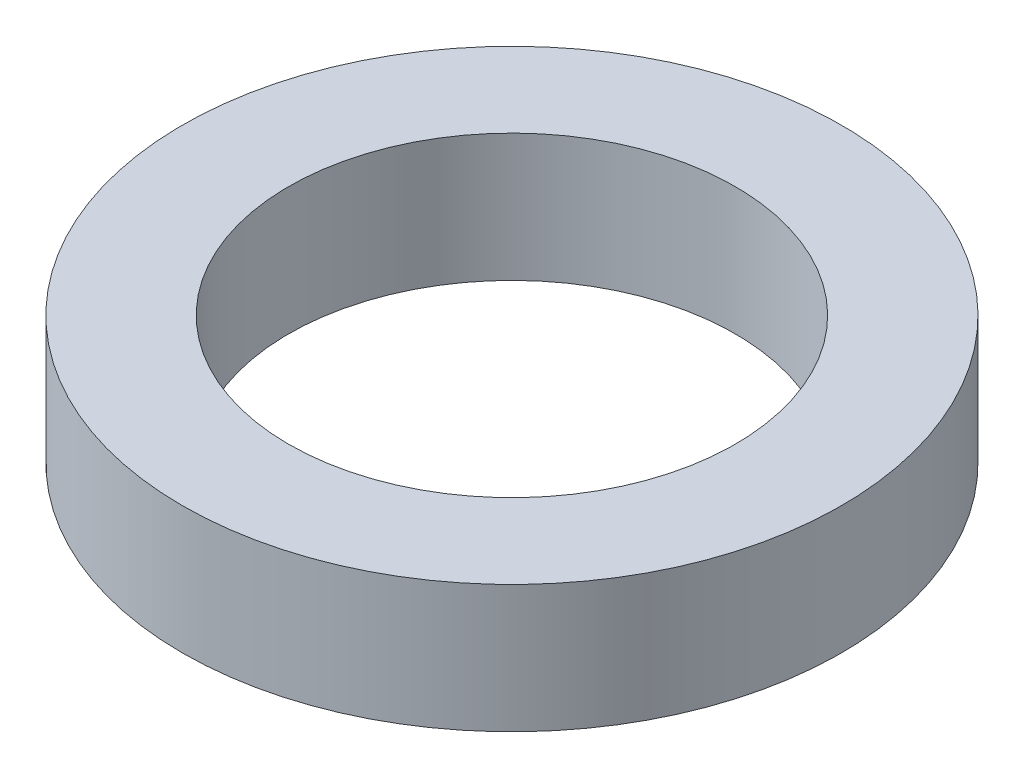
from build123d import *

# Parameters (mm, degrees)
SKETCH1_R           = 31
SKETCH1_R_2         = 21
BOSS_EXTRUDE1_DEPTH = 12


with BuildPart() as part:
    # Sketch1 → Boss-Extrude1 (new body)
    with BuildSketch(Plane(origin=(0, 0, 0), x_dir=(1, 0, 0), z_dir=(0, 1, 0))):
        with Locations(Location((0, 0, 0), (0, 0, 270))):
            Circle(SKETCH1_R)
        with Locations(Location((0, 0, 0), (0, 0, 270))):
            Circle(SKETCH1_R_2, mode=Mode.SUBTRACT)
    extrude(amount=BOSS_EXTRUDE1_DEPTH)


solid = part.part
